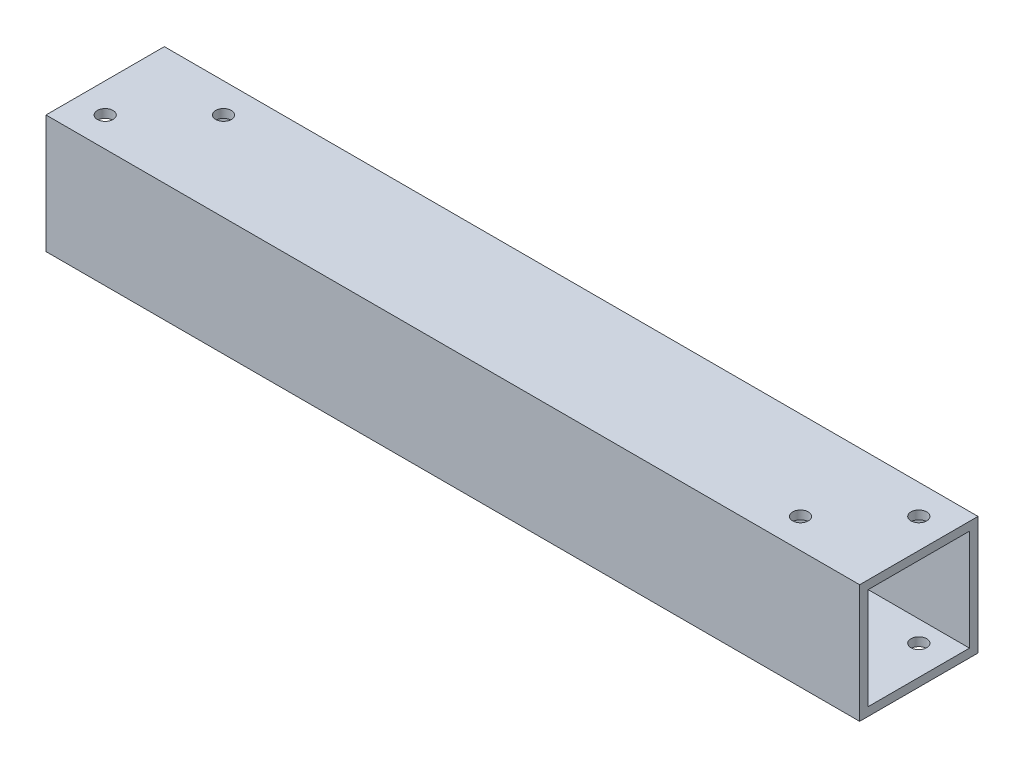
from build123d import *

# Parameters (mm, degrees)
SKETCH1_W          = 50.8
SKETCH1_H          = 50.8
SKETCH1_W_2        = 43.4848
SKETCH1_H_2        = 43.4848
EXTRUDE1_DEPTH     = 349.25
SKETCH3_R          = 3.37312
CUT_EXTRUDE1_DEPTH = 357.562536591


with BuildPart() as part:
    # Sketch1 → Extrude1 (new body)
    with BuildSketch(Plane(origin=(0, 0, 0), x_dir=(0, 0, -1), z_dir=(1, 0, 0))):
        with Locations((25.4, 25.4)):
            Rectangle(SKETCH1_W, SKETCH1_H)
        with Locations((25.4, 25.4)):
            Rectangle(SKETCH1_W_2, SKETCH1_H_2, mode=Mode.SUBTRACT)
    extrude(amount=EXTRUDE1_DEPTH)

    # Sketch3 → Cut-Extrude1 (cut, through all)
    with BuildSketch(Plane(origin=(0, 50.8, 0), x_dir=(1, 0, 0), z_dir=(0, 1, 0))):
        with Locations(Location((12.7, 12.7, 0), (0, 0, 270))):
            Circle(SKETCH3_R)
        with Locations(Location((38.1, 38.1, 0), (0, 0, 270))):
            Circle(SKETCH3_R)
        with Locations(Location((336.55, 38.1, 0), (0, 0, 270))):
            Circle(SKETCH3_R)
        with Locations(Location((311.15, 12.7, 0), (0, 0, 270))):
            Circle(SKETCH3_R)
    extrude(amount=-CUT_EXTRUDE1_DEPTH, mode=Mode.SUBTRACT)


solid = part.part
